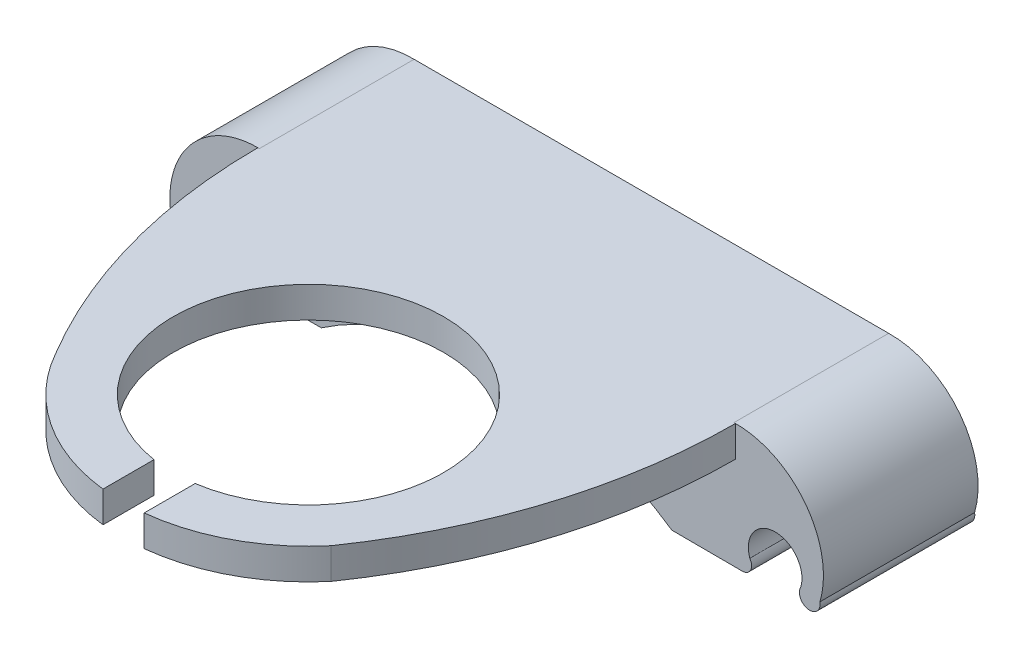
ISO-10303-21;
HEADER;
FILE_DESCRIPTION(('STEP AP214'),'2;1');
FILE_NAME('part.step','',(''),(''),'','','');
FILE_SCHEMA(('AUTOMOTIVE_DESIGN { 1 0 10303 214 1 1 1 1 }'));
ENDSEC;
DATA;
#1=APPLICATION_CONTEXT('core data for automotive mechanical design processes');
#2=APPLICATION_PROTOCOL_DEFINITION('international standard','automotive_design',2000,#1);
#3=PRODUCT_CONTEXT('',#1,'mechanical');
#4=PRODUCT('Part','Part','',(#3));
#5=PRODUCT_RELATED_PRODUCT_CATEGORY('part','',(#4));
#6=PRODUCT_DEFINITION_FORMATION('','',#4);
#7=PRODUCT_DEFINITION_CONTEXT('part definition',#1,'design');
#8=PRODUCT_DEFINITION('design','',#6,#7);
#9=PRODUCT_DEFINITION_SHAPE('','',#8);
#10=(LENGTH_UNIT() NAMED_UNIT(*) SI_UNIT(.MILLI.,.METRE.));
#11=(NAMED_UNIT(*) PLANE_ANGLE_UNIT() SI_UNIT($,.RADIAN.));
#12=(NAMED_UNIT(*) SI_UNIT($,.STERADIAN.) SOLID_ANGLE_UNIT());
#13=UNCERTAINTY_MEASURE_WITH_UNIT(LENGTH_MEASURE(1.E-05),#10,'distance_accuracy_value','');
#14=(GEOMETRIC_REPRESENTATION_CONTEXT(3) GLOBAL_UNCERTAINTY_ASSIGNED_CONTEXT((#13)) GLOBAL_UNIT_ASSIGNED_CONTEXT((#10,
#11,#12)) REPRESENTATION_CONTEXT('',''));
#15=CARTESIAN_POINT('',(0.,0.,0.));
#16=DIRECTION('',(0.,0.,1.));
#17=DIRECTION('',(1.,0.,0.));
#18=AXIS2_PLACEMENT_3D('',#15,#16,#17);
#19=CARTESIAN_POINT('',(-54.7671071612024,12.0368571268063,15.));
#20=DIRECTION('',(0.,-1.,0.));
#21=DIRECTION('',(1.,0.,0.));
#22=AXIS2_PLACEMENT_3D('',#19,#20,#21);
#23=PLANE('',#22);
#24=DIRECTION('',(0.,0.,1.));
#25=VECTOR('',#24,1.);
#26=CARTESIAN_POINT('',(-33.7671071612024,12.0368571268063,15.));
#27=LINE('',#26,#25);
#28=CARTESIAN_POINT('',(-33.7671071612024,12.0368571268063,46.2129085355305));
#29=VERTEX_POINT('',#28);
#30=CARTESIAN_POINT('',(-33.7671071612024,12.0368571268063,51.1567570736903));
#31=VERTEX_POINT('',#30);
#32=EDGE_CURVE('E332',#29,#31,#27,.T.);
#33=ORIENTED_EDGE('',*,*,#32,.F.);
#34=CARTESIAN_POINT('',(-31.7381994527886,12.0368571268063,33.2709792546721));
#35=DIRECTION('',(0.,-1.,0.));
#36=DIRECTION('',(1.,0.,0.));
#37=AXIS2_PLACEMENT_3D('',#34,#35,#36);
#38=CIRCLE('',#37,13.1);
#39=CARTESIAN_POINT('',(-29.7671071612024,12.0368571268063,46.221840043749));
#40=VERTEX_POINT('',#39);
#41=EDGE_CURVE('E191',#29,#40,#38,.T.);
#42=ORIENTED_EDGE('',*,*,#41,.T.);
#43=DIRECTION('',(0.,0.,-1.));
#44=VECTOR('',#43,1.);
#45=CARTESIAN_POINT('',(-29.7671071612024,12.0368571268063,15.));
#46=LINE('',#45,#44);
#47=CARTESIAN_POINT('',(-29.7671071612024,12.0368571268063,51.1632208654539));
#48=VERTEX_POINT('',#47);
#49=EDGE_CURVE('E54',#48,#40,#46,.T.);
#50=ORIENTED_EDGE('',*,*,#49,.F.);
#51=CARTESIAN_POINT('',(-31.7381994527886,12.0368571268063,33.2709792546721));
#52=DIRECTION('',(0.,-1.,0.));
#53=DIRECTION('',(1.,0.,0.));
#54=AXIS2_PLACEMENT_3D('',#51,#52,#53);
#55=CIRCLE('',#54,18.0004865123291);
#56=CARTESIAN_POINT('',(-17.9569114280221,12.0368571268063,44.8508590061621));
#57=VERTEX_POINT('',#56);
#58=EDGE_CURVE('E203',#57,#48,#55,.T.);
#59=ORIENTED_EDGE('',*,*,#58,.F.);
#60=CARTESIAN_POINT('',(-61.0050093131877,12.0368571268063,15.));
#61=DIRECTION('',(0.,-1.,0.));
#62=DIRECTION('',(1.,0.,0.));
#63=AXIS2_PLACEMENT_3D('',#60,#61,#62);
#64=CIRCLE('',#63,52.3852318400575);
#65=CARTESIAN_POINT('',(-8.61977747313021,12.0368571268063,15.));
#66=VERTEX_POINT('',#65);
#67=EDGE_CURVE('E211',#66,#57,#64,.T.);
#68=ORIENTED_EDGE('',*,*,#67,.F.);
#69=DIRECTION('',(1.,0.,0.));
#70=VECTOR('',#69,1.);
#71=CARTESIAN_POINT('',(-54.9144368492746,12.0368571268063,15.));
#72=LINE('',#71,#70);
#73=CARTESIAN_POINT('',(-8.76710716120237,12.0368571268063,15.));
#74=VERTEX_POINT('',#73);
#75=EDGE_CURVE('E180',#74,#66,#72,.T.);
#76=ORIENTED_EDGE('',*,*,#75,.F.);
#77=DIRECTION('',(0.,0.,-1.));
#78=VECTOR('',#77,1.);
#79=CARTESIAN_POINT('',(-8.76710716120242,12.0368571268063,15.));
#80=LINE('',#79,#78);
#81=CARTESIAN_POINT('',(-8.76710716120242,12.0368571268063,0.));
#82=VERTEX_POINT('',#81);
#83=EDGE_CURVE('E293',#74,#82,#80,.T.);
#84=ORIENTED_EDGE('',*,*,#83,.T.);
#85=DIRECTION('',(-1.,0.,0.));
#86=VECTOR('',#85,1.);
#87=CARTESIAN_POINT('',(-54.7671071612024,12.0368571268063,0.));
#88=LINE('',#87,#86);
#89=CARTESIAN_POINT('',(-54.7671071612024,12.0368571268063,0.));
#90=VERTEX_POINT('',#89);
#91=EDGE_CURVE('E265',#82,#90,#88,.T.);
#92=ORIENTED_EDGE('',*,*,#91,.T.);
#93=DIRECTION('',(0.,0.,-1.));
#94=VECTOR('',#93,1.);
#95=CARTESIAN_POINT('',(-54.7671071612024,12.0368571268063,15.));
#96=LINE('',#95,#94);
#97=CARTESIAN_POINT('',(-54.7671071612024,12.0368571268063,15.));
#98=VERTEX_POINT('',#97);
#99=EDGE_CURVE('E290',#98,#90,#96,.T.);
#100=ORIENTED_EDGE('',*,*,#99,.F.);
#101=CARTESIAN_POINT('',(-54.9144368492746,12.0368571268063,15.));
#102=VERTEX_POINT('',#101);
#103=EDGE_CURVE('E193',#102,#98,#72,.T.);
#104=ORIENTED_EDGE('',*,*,#103,.F.);
#105=CARTESIAN_POINT('',(-2.1533602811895,12.0368571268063,15.));
#106=DIRECTION('',(0.,-1.,0.));
#107=DIRECTION('',(-1.,0.,0.));
#108=AXIS2_PLACEMENT_3D('',#105,#106,#107);
#109=CIRCLE('',#108,52.7610765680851);
#110=CARTESIAN_POINT('',(-47.4533224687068,12.0368571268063,42.0489302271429));
#111=VERTEX_POINT('',#110);
#112=EDGE_CURVE('E190',#111,#102,#109,.T.);
#113=ORIENTED_EDGE('',*,*,#112,.F.);
#114=EDGE_CURVE('E213',#31,#111,#55,.T.);
#115=ORIENTED_EDGE('',*,*,#114,.F.);
#116=EDGE_LOOP('',(#33,#42,#50,#59,#68,#76,#84,#92,#100,#104,#113,#115));
#117=FACE_BOUND('',#116,.T.);
#118=ADVANCED_FACE('F39',(#117),#23,.F.);
#119=CARTESIAN_POINT('',(-2.1533602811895,9.03685712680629,15.));
#120=DIRECTION('',(0.,1.,0.));
#121=DIRECTION('',(-1.,0.,0.));
#122=AXIS2_PLACEMENT_3D('',#119,#120,#121);
#123=PLANE('',#122);
#124=DIRECTION('',(0.,0.,-1.));
#125=VECTOR('',#124,1.);
#126=CARTESIAN_POINT('',(-33.7671071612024,9.03685712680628,15.));
#127=LINE('',#126,#125);
#128=CARTESIAN_POINT('',(-33.7671071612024,9.03685712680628,51.1567570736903));
#129=VERTEX_POINT('',#128);
#130=CARTESIAN_POINT('',(-33.7671071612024,9.03685712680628,46.2129085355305));
#131=VERTEX_POINT('',#130);
#132=EDGE_CURVE('E62',#129,#131,#127,.T.);
#133=ORIENTED_EDGE('',*,*,#132,.F.);
#134=CARTESIAN_POINT('',(-31.7381994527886,9.03685712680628,33.2709792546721));
#135=DIRECTION('',(0.,-1.,0.));
#136=DIRECTION('',(1.,0.,0.));
#137=AXIS2_PLACEMENT_3D('',#134,#135,#136);
#138=CIRCLE('',#137,18.0004865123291);
#139=CARTESIAN_POINT('',(-47.4533224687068,9.03685712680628,42.0489302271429));
#140=VERTEX_POINT('',#139);
#141=EDGE_CURVE('E207',#129,#140,#138,.T.);
#142=ORIENTED_EDGE('',*,*,#141,.T.);
#143=CARTESIAN_POINT('',(-2.1533602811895,9.03685712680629,15.));
#144=DIRECTION('',(0.,-1.,0.));
#145=DIRECTION('',(-1.,0.,0.));
#146=AXIS2_PLACEMENT_3D('',#143,#144,#145);
#147=CIRCLE('',#146,52.7610765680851);
#148=CARTESIAN_POINT('',(-54.9144368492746,9.03685712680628,15.));
#149=VERTEX_POINT('',#148);
#150=EDGE_CURVE('E200',#140,#149,#147,.T.);
#151=ORIENTED_EDGE('',*,*,#150,.T.);
#152=DIRECTION('',(1.,0.,0.));
#153=VECTOR('',#152,1.);
#154=CARTESIAN_POINT('',(-54.9144368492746,9.03685712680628,15.));
#155=LINE('',#154,#153);
#156=CARTESIAN_POINT('',(-8.61977747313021,9.03685712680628,15.));
#157=VERTEX_POINT('',#156);
#158=EDGE_CURVE('E202',#149,#157,#155,.T.);
#159=ORIENTED_EDGE('',*,*,#158,.T.);
#160=CARTESIAN_POINT('',(-61.0050093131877,9.03685712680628,15.));
#161=DIRECTION('',(0.,-1.,0.));
#162=DIRECTION('',(1.,0.,0.));
#163=AXIS2_PLACEMENT_3D('',#160,#161,#162);
#164=CIRCLE('',#163,52.3852318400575);
#165=CARTESIAN_POINT('',(-17.9569114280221,9.03685712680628,44.8508590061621));
#166=VERTEX_POINT('',#165);
#167=EDGE_CURVE('E205',#157,#166,#164,.T.);
#168=ORIENTED_EDGE('',*,*,#167,.T.);
#169=CARTESIAN_POINT('',(-29.7671071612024,9.03685712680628,51.1632208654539));
#170=VERTEX_POINT('',#169);
#171=EDGE_CURVE('E187',#166,#170,#138,.T.);
#172=ORIENTED_EDGE('',*,*,#171,.T.);
#173=DIRECTION('',(0.,0.,1.));
#174=VECTOR('',#173,1.);
#175=CARTESIAN_POINT('',(-29.7671071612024,9.03685712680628,15.));
#176=LINE('',#175,#174);
#177=CARTESIAN_POINT('',(-29.7671071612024,9.03685712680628,46.221840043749));
#178=VERTEX_POINT('',#177);
#179=EDGE_CURVE('E174',#178,#170,#176,.T.);
#180=ORIENTED_EDGE('',*,*,#179,.F.);
#181=CARTESIAN_POINT('',(-31.7381994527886,9.03685712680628,33.2709792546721));
#182=DIRECTION('',(0.,-1.,0.));
#183=DIRECTION('',(1.,0.,0.));
#184=AXIS2_PLACEMENT_3D('',#181,#182,#183);
#185=CIRCLE('',#184,13.1);
#186=EDGE_CURVE('E185',#131,#178,#185,.T.);
#187=ORIENTED_EDGE('',*,*,#186,.F.);
#188=EDGE_LOOP('',(#133,#142,#151,#159,#168,#172,#180,#187));
#189=FACE_BOUND('',#188,.T.);
#190=ADVANCED_FACE('F184',(#189),#123,.F.);
#191=CARTESIAN_POINT('',(-31.7381994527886,9.03685712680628,33.2709792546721));
#192=DIRECTION('',(0.,1.,0.));
#193=DIRECTION('',(-1.,0.,0.));
#194=AXIS2_PLACEMENT_3D('',#191,#192,#193);
#195=CYLINDRICAL_SURFACE('',#194,18.0004865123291);
#196=DIRECTION('',(0.,1.,0.));
#197=VECTOR('',#196,1.);
#198=CARTESIAN_POINT('',(-33.7671071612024,9.03685712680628,51.1567570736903));
#199=LINE('',#198,#197);
#200=EDGE_CURVE('E195',#31,#129,#199,.F.);
#201=ORIENTED_EDGE('',*,*,#200,.F.);
#202=ORIENTED_EDGE('',*,*,#114,.T.);
#203=DIRECTION('',(0.,1.,0.));
#204=VECTOR('',#203,1.);
#205=CARTESIAN_POINT('',(-47.4533224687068,9.03685712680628,42.0489302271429));
#206=LINE('',#205,#204);
#207=EDGE_CURVE('E208',#140,#111,#206,.T.);
#208=ORIENTED_EDGE('',*,*,#207,.F.);
#209=ORIENTED_EDGE('',*,*,#141,.F.);
#210=EDGE_LOOP('',(#201,#202,#208,#209));
#211=FACE_BOUND('',#210,.T.);
#212=ADVANCED_FACE('F341',(#211),#195,.T.);
#213=DIRECTION('',(0.,1.,0.));
#214=VECTOR('',#213,1.);
#215=CARTESIAN_POINT('',(-29.7671071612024,9.03685712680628,51.1632208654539));
#216=LINE('',#215,#214);
#217=EDGE_CURVE('E330',#170,#48,#216,.T.);
#218=ORIENTED_EDGE('',*,*,#217,.F.);
#219=ORIENTED_EDGE('',*,*,#171,.F.);
#220=DIRECTION('',(0.,1.,0.));
#221=VECTOR('',#220,1.);
#222=CARTESIAN_POINT('',(-17.9569114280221,9.03685712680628,44.8508590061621));
#223=LINE('',#222,#221);
#224=EDGE_CURVE('E218',#166,#57,#223,.T.);
#225=ORIENTED_EDGE('',*,*,#224,.T.);
#226=ORIENTED_EDGE('',*,*,#58,.T.);
#227=EDGE_LOOP('',(#218,#219,#225,#226));
#228=FACE_BOUND('',#227,.T.);
#229=ADVANCED_FACE('F329',(#228),#195,.T.);
#230=CARTESIAN_POINT('',(-31.7381994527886,9.03685712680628,33.2709792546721));
#231=DIRECTION('',(0.,1.,0.));
#232=DIRECTION('',(-1.,0.,0.));
#233=AXIS2_PLACEMENT_3D('',#230,#231,#232);
#234=CYLINDRICAL_SURFACE('',#233,13.1);
#235=ORIENTED_EDGE('',*,*,#41,.F.);
#236=DIRECTION('',(0.,1.,0.));
#237=VECTOR('',#236,1.);
#238=CARTESIAN_POINT('',(-33.7671071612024,9.03685712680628,46.2129085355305));
#239=LINE('',#238,#237);
#240=EDGE_CURVE('E11',#29,#131,#239,.F.);
#241=ORIENTED_EDGE('',*,*,#240,.T.);
#242=ORIENTED_EDGE('',*,*,#186,.T.);
#243=DIRECTION('',(0.,1.,0.));
#244=VECTOR('',#243,1.);
#245=CARTESIAN_POINT('',(-29.7671071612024,9.03685712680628,46.221840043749));
#246=LINE('',#245,#244);
#247=EDGE_CURVE('E47',#178,#40,#246,.T.);
#248=ORIENTED_EDGE('',*,*,#247,.T.);
#249=EDGE_LOOP('',(#235,#241,#242,#248));
#250=FACE_BOUND('',#249,.T.);
#251=ADVANCED_FACE('F189',(#250),#234,.F.);
#252=CARTESIAN_POINT('',(-31.7671071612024,-24.9702545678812,15.));
#253=DIRECTION('',(0.,0.,-1.));
#254=DIRECTION('',(-1.,0.,0.));
#255=AXIS2_PLACEMENT_3D('',#252,#253,#254);
#256=CYLINDRICAL_SURFACE('',#255,30.2);
#257=CARTESIAN_POINT('',(-31.7671071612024,-24.9702545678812,0.));
#258=DIRECTION('',(0.,0.,-1.));
#259=DIRECTION('',(-1.,0.,0.));
#260=AXIS2_PLACEMENT_3D('',#257,#258,#259);
#261=CIRCLE('',#260,30.2);
#262=CARTESIAN_POINT('',(-48.7531716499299,0.,0.));
#263=VERTEX_POINT('',#262);
#264=CARTESIAN_POINT('',(-14.7810426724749,0.,0.));
#265=VERTEX_POINT('',#264);
#266=EDGE_CURVE('E226',#263,#265,#261,.T.);
#267=ORIENTED_EDGE('',*,*,#266,.T.);
#268=DIRECTION('',(0.,0.,-1.));
#269=VECTOR('',#268,1.);
#270=CARTESIAN_POINT('',(-14.7810426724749,0.,15.));
#271=LINE('',#270,#269);
#272=CARTESIAN_POINT('',(-14.7810426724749,0.,15.));
#273=VERTEX_POINT('',#272);
#274=EDGE_CURVE('E308',#273,#265,#271,.T.);
#275=ORIENTED_EDGE('',*,*,#274,.F.);
#276=CARTESIAN_POINT('',(-31.7671071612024,-24.9702545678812,15.));
#277=DIRECTION('',(0.,0.,-1.));
#278=DIRECTION('',(-1.,0.,0.));
#279=AXIS2_PLACEMENT_3D('',#276,#277,#278);
#280=CIRCLE('',#279,30.2);
#281=CARTESIAN_POINT('',(-48.7531716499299,0.,15.));
#282=VERTEX_POINT('',#281);
#283=EDGE_CURVE('E227',#282,#273,#280,.T.);
#284=ORIENTED_EDGE('',*,*,#283,.F.);
#285=DIRECTION('',(0.,0.,-1.));
#286=VECTOR('',#285,1.);
#287=CARTESIAN_POINT('',(-48.7531716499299,0.,15.));
#288=LINE('',#287,#286);
#289=EDGE_CURVE('E252',#282,#263,#288,.T.);
#290=ORIENTED_EDGE('',*,*,#289,.T.);
#291=EDGE_LOOP('',(#267,#275,#284,#290));
#292=FACE_BOUND('',#291,.T.);
#293=ADVANCED_FACE('F41',(#292),#256,.F.);
#294=CARTESIAN_POINT('',(-14.7810426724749,0.,15.));
#295=DIRECTION('',(0.00375470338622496,0.999992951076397,0.));
#296=DIRECTION('',(-0.999992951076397,0.00375470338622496,0.));
#297=AXIS2_PLACEMENT_3D('',#294,#295,#296);
#298=PLANE('',#297);
#299=DIRECTION('',(0.999992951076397,-0.00375470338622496,0.));
#300=VECTOR('',#299,1.);
#301=CARTESIAN_POINT('',(-14.7810426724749,0.,0.));
#302=LINE('',#301,#300);
#303=CARTESIAN_POINT('',(-7.95931495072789,-0.0256137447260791,0.));
#304=VERTEX_POINT('',#303);
#305=EDGE_CURVE('E255',#265,#304,#302,.T.);
#306=ORIENTED_EDGE('',*,*,#305,.T.);
#307=DIRECTION('',(0.,0.,-1.));
#308=VECTOR('',#307,1.);
#309=CARTESIAN_POINT('',(-7.95931495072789,-0.0256137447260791,15.));
#310=LINE('',#309,#308);
#311=CARTESIAN_POINT('',(-7.95931495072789,-0.0256137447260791,15.));
#312=VERTEX_POINT('',#311);
#313=EDGE_CURVE('E305',#312,#304,#310,.T.);
#314=ORIENTED_EDGE('',*,*,#313,.F.);
#315=DIRECTION('',(0.999992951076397,-0.00375470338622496,0.));
#316=VECTOR('',#315,1.);
#317=CARTESIAN_POINT('',(-14.7810426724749,0.,15.));
#318=LINE('',#317,#316);
#319=EDGE_CURVE('E230',#273,#312,#318,.T.);
#320=ORIENTED_EDGE('',*,*,#319,.F.);
#321=ORIENTED_EDGE('',*,*,#274,.T.);
#322=EDGE_LOOP('',(#306,#314,#320,#321));
#323=FACE_BOUND('',#322,.T.);
#324=ADVANCED_FACE('F382',(#323),#298,.F.);
#325=CARTESIAN_POINT('',(-7.95591623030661,0.87956999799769,15.));
#326=DIRECTION('',(0.,0.,-1.));
#327=DIRECTION('',(-1.,0.,0.));
#328=AXIS2_PLACEMENT_3D('',#325,#326,#327);
#329=CYLINDRICAL_SURFACE('',#328,0.905190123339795);
#330=CARTESIAN_POINT('',(-7.95591623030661,0.87956999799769,0.));
#331=DIRECTION('',(0.,0.,1.));
#332=DIRECTION('',(1.,0.,0.));
#333=AXIS2_PLACEMENT_3D('',#330,#331,#332);
#334=CIRCLE('',#333,0.905190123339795);
#335=CARTESIAN_POINT('',(-7.22438969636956,1.41270983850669,0.));
#336=VERTEX_POINT('',#335);
#337=EDGE_CURVE('E257',#304,#336,#334,.T.);
#338=ORIENTED_EDGE('',*,*,#337,.T.);
#339=DIRECTION('',(0.,0.,-1.));
#340=VECTOR('',#339,1.);
#341=CARTESIAN_POINT('',(-7.22438969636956,1.41270983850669,15.));
#342=LINE('',#341,#340);
#343=CARTESIAN_POINT('',(-7.22438969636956,1.41270983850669,15.));
#344=VERTEX_POINT('',#343);
#345=EDGE_CURVE('E302',#344,#336,#342,.T.);
#346=ORIENTED_EDGE('',*,*,#345,.F.);
#347=CARTESIAN_POINT('',(-7.95591623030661,0.87956999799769,15.));
#348=DIRECTION('',(0.,0.,1.));
#349=DIRECTION('',(1.,0.,0.));
#350=AXIS2_PLACEMENT_3D('',#347,#348,#349);
#351=CIRCLE('',#350,0.905190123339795);
#352=EDGE_CURVE('E233',#312,#344,#351,.T.);
#353=ORIENTED_EDGE('',*,*,#352,.F.);
#354=ORIENTED_EDGE('',*,*,#313,.T.);
#355=EDGE_LOOP('',(#338,#346,#353,#354));
#356=FACE_BOUND('',#355,.T.);
#357=ADVANCED_FACE('F385',(#356),#329,.T.);
#358=CARTESIAN_POINT('',(-4.76710716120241,2.26227592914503,15.));
#359=DIRECTION('',(0.,0.,-1.));
#360=DIRECTION('',(-1.,0.,0.));
#361=AXIS2_PLACEMENT_3D('',#358,#359,#360);
#362=CYLINDRICAL_SURFACE('',#361,2.6);
#363=CARTESIAN_POINT('',(-4.76710716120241,2.26227592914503,0.));
#364=DIRECTION('',(0.,0.,-1.));
#365=DIRECTION('',(-1.,0.,0.));
#366=AXIS2_PLACEMENT_3D('',#363,#364,#365);
#367=CIRCLE('',#366,2.6);
#368=CARTESIAN_POINT('',(-2.31050998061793,1.4107301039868,0.));
#369=VERTEX_POINT('',#368);
#370=EDGE_CURVE('E259',#336,#369,#367,.T.);
#371=ORIENTED_EDGE('',*,*,#370,.T.);
#372=DIRECTION('',(0.,0.,-1.));
#373=VECTOR('',#372,1.);
#374=CARTESIAN_POINT('',(-2.31050998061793,1.4107301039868,15.));
#375=LINE('',#374,#373);
#376=CARTESIAN_POINT('',(-2.31050998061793,1.4107301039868,15.));
#377=VERTEX_POINT('',#376);
#378=EDGE_CURVE('E299',#377,#369,#375,.T.);
#379=ORIENTED_EDGE('',*,*,#378,.F.);
#380=CARTESIAN_POINT('',(-4.76710716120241,2.26227592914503,15.));
#381=DIRECTION('',(0.,0.,-1.));
#382=DIRECTION('',(-1.,0.,0.));
#383=AXIS2_PLACEMENT_3D('',#380,#381,#382);
#384=CIRCLE('',#383,2.6);
#385=EDGE_CURVE('E235',#344,#377,#384,.T.);
#386=ORIENTED_EDGE('',*,*,#385,.F.);
#387=ORIENTED_EDGE('',*,*,#345,.T.);
#388=EDGE_LOOP('',(#371,#379,#386,#387));
#389=FACE_BOUND('',#388,.T.);
#390=ADVANCED_FACE('F392',(#389),#362,.F.);
#391=CARTESIAN_POINT('',(-1.419234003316,0.957268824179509,15.));
#392=DIRECTION('',(0.,0.,-1.));
#393=DIRECTION('',(-1.,0.,0.));
#394=AXIS2_PLACEMENT_3D('',#391,#392,#393);
#395=CYLINDRICAL_SURFACE('',#394,0.999999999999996);
#396=CARTESIAN_POINT('',(-1.419234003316,0.957268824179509,0.));
#397=DIRECTION('',(0.,0.,1.));
#398=DIRECTION('',(1.,0.,0.));
#399=AXIS2_PLACEMENT_3D('',#396,#397,#398);
#400=CIRCLE('',#399,0.999999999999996);
#401=CARTESIAN_POINT('',(-0.438470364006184,1.15246791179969,0.));
#402=VERTEX_POINT('',#401);
#403=EDGE_CURVE('E261',#369,#402,#400,.T.);
#404=ORIENTED_EDGE('',*,*,#403,.T.);
#405=DIRECTION('',(0.,0.,-1.));
#406=VECTOR('',#405,1.);
#407=CARTESIAN_POINT('',(-0.438470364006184,1.15246791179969,15.));
#408=LINE('',#407,#406);
#409=CARTESIAN_POINT('',(-0.438470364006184,1.15246791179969,15.));
#410=VERTEX_POINT('',#409);
#411=EDGE_CURVE('E296',#410,#402,#408,.T.);
#412=ORIENTED_EDGE('',*,*,#411,.F.);
#413=CARTESIAN_POINT('',(-1.419234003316,0.957268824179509,15.));
#414=DIRECTION('',(0.,0.,1.));
#415=DIRECTION('',(1.,0.,0.));
#416=AXIS2_PLACEMENT_3D('',#413,#414,#415);
#417=CIRCLE('',#416,0.999999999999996);
#418=EDGE_CURVE('E237',#377,#410,#417,.T.);
#419=ORIENTED_EDGE('',*,*,#418,.F.);
#420=ORIENTED_EDGE('',*,*,#378,.T.);
#421=EDGE_LOOP('',(#404,#412,#419,#420));
#422=FACE_BOUND('',#421,.T.);
#423=ADVANCED_FACE('F395',(#422),#395,.T.);
#424=CARTESIAN_POINT('',(-8.59668938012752,3.53856566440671,15.));
#425=DIRECTION('',(0.,0.,-1.));
#426=DIRECTION('',(-1.,0.,0.));
#427=AXIS2_PLACEMENT_3D('',#424,#425,#426);
#428=CYLINDRICAL_SURFACE('',#427,8.5);
#429=CARTESIAN_POINT('',(-8.59668938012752,3.53856566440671,0.));
#430=DIRECTION('',(0.,0.,1.));
#431=DIRECTION('',(1.,0.,0.));
#432=AXIS2_PLACEMENT_3D('',#429,#430,#431);
#433=CIRCLE('',#432,8.5);
#434=EDGE_CURVE('E263',#402,#82,#433,.T.);
#435=ORIENTED_EDGE('',*,*,#434,.T.);
#436=ORIENTED_EDGE('',*,*,#83,.F.);
#437=CARTESIAN_POINT('',(-8.59668938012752,3.53856566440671,15.));
#438=DIRECTION('',(0.,0.,1.));
#439=DIRECTION('',(1.,0.,0.));
#440=AXIS2_PLACEMENT_3D('',#437,#438,#439);
#441=CIRCLE('',#440,8.5);
#442=EDGE_CURVE('E239',#410,#74,#441,.T.);
#443=ORIENTED_EDGE('',*,*,#442,.F.);
#444=ORIENTED_EDGE('',*,*,#411,.T.);
#445=EDGE_LOOP('',(#435,#436,#443,#444));
#446=FACE_BOUND('',#445,.T.);
#447=ADVANCED_FACE('F398',(#446),#428,.T.);
#448=CARTESIAN_POINT('',(-54.9375249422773,3.5385656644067,15.));
#449=DIRECTION('',(0.,0.,-1.));
#450=DIRECTION('',(-1.,0.,0.));
#451=AXIS2_PLACEMENT_3D('',#448,#449,#450);
#452=CYLINDRICAL_SURFACE('',#451,8.5);
#453=CARTESIAN_POINT('',(-54.9375249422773,3.5385656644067,0.));
#454=DIRECTION('',(0.,0.,1.));
#455=DIRECTION('',(-1.,0.,0.));
#456=AXIS2_PLACEMENT_3D('',#453,#454,#455);
#457=CIRCLE('',#456,8.5);
#458=CARTESIAN_POINT('',(-63.0957439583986,1.15246791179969,0.));
#459=VERTEX_POINT('',#458);
#460=EDGE_CURVE('E267',#90,#459,#457,.T.);
#461=ORIENTED_EDGE('',*,*,#460,.T.);
#462=DIRECTION('',(0.,0.,-1.));
#463=VECTOR('',#462,1.);
#464=CARTESIAN_POINT('',(-63.0957439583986,1.15246791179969,15.));
#465=LINE('',#464,#463);
#466=CARTESIAN_POINT('',(-63.0957439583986,1.15246791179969,15.));
#467=VERTEX_POINT('',#466);
#468=EDGE_CURVE('E287',#467,#459,#465,.T.);
#469=ORIENTED_EDGE('',*,*,#468,.F.);
#470=CARTESIAN_POINT('',(-54.9375249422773,3.5385656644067,15.));
#471=DIRECTION('',(0.,0.,1.));
#472=DIRECTION('',(-1.,0.,0.));
#473=AXIS2_PLACEMENT_3D('',#470,#471,#472);
#474=CIRCLE('',#473,8.5);
#475=EDGE_CURVE('E242',#98,#467,#474,.T.);
#476=ORIENTED_EDGE('',*,*,#475,.F.);
#477=ORIENTED_EDGE('',*,*,#99,.T.);
#478=EDGE_LOOP('',(#461,#469,#476,#477));
#479=FACE_BOUND('',#478,.T.);
#480=ADVANCED_FACE('F353',(#479),#452,.T.);
#481=CARTESIAN_POINT('',(-62.1149803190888,0.957268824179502,15.));
#482=DIRECTION('',(0.,0.,-1.));
#483=DIRECTION('',(-1.,0.,0.));
#484=AXIS2_PLACEMENT_3D('',#481,#482,#483);
#485=CYLINDRICAL_SURFACE('',#484,0.999999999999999);
#486=CARTESIAN_POINT('',(-62.1149803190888,0.957268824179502,0.));
#487=DIRECTION('',(0.,0.,1.));
#488=DIRECTION('',(-1.,0.,0.));
#489=AXIS2_PLACEMENT_3D('',#486,#487,#488);
#490=CIRCLE('',#489,0.999999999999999);
#491=CARTESIAN_POINT('',(-61.2237043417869,1.4107301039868,0.));
#492=VERTEX_POINT('',#491);
#493=EDGE_CURVE('E269',#459,#492,#490,.T.);
#494=ORIENTED_EDGE('',*,*,#493,.T.);
#495=DIRECTION('',(0.,0.,-1.));
#496=VECTOR('',#495,1.);
#497=CARTESIAN_POINT('',(-61.2237043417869,1.4107301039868,15.));
#498=LINE('',#497,#496);
#499=CARTESIAN_POINT('',(-61.2237043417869,1.4107301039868,15.));
#500=VERTEX_POINT('',#499);
#501=EDGE_CURVE('E284',#500,#492,#498,.T.);
#502=ORIENTED_EDGE('',*,*,#501,.F.);
#503=CARTESIAN_POINT('',(-62.1149803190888,0.957268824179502,15.));
#504=DIRECTION('',(0.,0.,1.));
#505=DIRECTION('',(-1.,0.,0.));
#506=AXIS2_PLACEMENT_3D('',#503,#504,#505);
#507=CIRCLE('',#506,0.999999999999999);
#508=EDGE_CURVE('E244',#467,#500,#507,.T.);
#509=ORIENTED_EDGE('',*,*,#508,.F.);
#510=ORIENTED_EDGE('',*,*,#468,.T.);
#511=EDGE_LOOP('',(#494,#502,#509,#510));
#512=FACE_BOUND('',#511,.T.);
#513=ADVANCED_FACE('F358',(#512),#485,.T.);
#514=CARTESIAN_POINT('',(-58.7671071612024,2.26227592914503,15.));
#515=DIRECTION('',(0.,0.,-1.));
#516=DIRECTION('',(-1.,0.,0.));
#517=AXIS2_PLACEMENT_3D('',#514,#515,#516);
#518=CYLINDRICAL_SURFACE('',#517,2.6);
#519=CARTESIAN_POINT('',(-58.7671071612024,2.26227592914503,0.));
#520=DIRECTION('',(0.,0.,-1.));
#521=DIRECTION('',(1.,0.,0.));
#522=AXIS2_PLACEMENT_3D('',#519,#520,#521);
#523=CIRCLE('',#522,2.6);
#524=CARTESIAN_POINT('',(-56.3098246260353,1.41270983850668,0.));
#525=VERTEX_POINT('',#524);
#526=EDGE_CURVE('E271',#492,#525,#523,.T.);
#527=ORIENTED_EDGE('',*,*,#526,.T.);
#528=DIRECTION('',(0.,0.,-1.));
#529=VECTOR('',#528,1.);
#530=CARTESIAN_POINT('',(-56.3098246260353,1.41270983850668,15.));
#531=LINE('',#530,#529);
#532=CARTESIAN_POINT('',(-56.3098246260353,1.41270983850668,15.));
#533=VERTEX_POINT('',#532);
#534=EDGE_CURVE('E281',#533,#525,#531,.T.);
#535=ORIENTED_EDGE('',*,*,#534,.F.);
#536=CARTESIAN_POINT('',(-58.7671071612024,2.26227592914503,15.));
#537=DIRECTION('',(0.,0.,-1.));
#538=DIRECTION('',(1.,0.,0.));
#539=AXIS2_PLACEMENT_3D('',#536,#537,#538);
#540=CIRCLE('',#539,2.6);
#541=EDGE_CURVE('E246',#500,#533,#540,.T.);
#542=ORIENTED_EDGE('',*,*,#541,.F.);
#543=ORIENTED_EDGE('',*,*,#501,.T.);
#544=EDGE_LOOP('',(#527,#535,#542,#543));
#545=FACE_BOUND('',#544,.T.);
#546=ADVANCED_FACE('F364',(#545),#518,.F.);
#547=CARTESIAN_POINT('',(-55.5782980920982,0.879569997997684,15.));
#548=DIRECTION('',(0.,0.,-1.));
#549=DIRECTION('',(-1.,0.,0.));
#550=AXIS2_PLACEMENT_3D('',#547,#548,#549);
#551=CYLINDRICAL_SURFACE('',#550,0.905190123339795);
#552=CARTESIAN_POINT('',(-55.5782980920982,0.879569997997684,0.));
#553=DIRECTION('',(0.,0.,1.));
#554=DIRECTION('',(-1.,0.,0.));
#555=AXIS2_PLACEMENT_3D('',#552,#553,#554);
#556=CIRCLE('',#555,0.905190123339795);
#557=CARTESIAN_POINT('',(-55.5748993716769,-0.0256137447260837,0.));
#558=VERTEX_POINT('',#557);
#559=EDGE_CURVE('E273',#525,#558,#556,.T.);
#560=ORIENTED_EDGE('',*,*,#559,.T.);
#561=DIRECTION('',(0.,0.,-1.));
#562=VECTOR('',#561,1.);
#563=CARTESIAN_POINT('',(-55.5748993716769,-0.0256137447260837,15.));
#564=LINE('',#563,#562);
#565=CARTESIAN_POINT('',(-55.5748993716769,-0.0256137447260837,15.));
#566=VERTEX_POINT('',#565);
#567=EDGE_CURVE('E278',#566,#558,#564,.T.);
#568=ORIENTED_EDGE('',*,*,#567,.F.);
#569=CARTESIAN_POINT('',(-55.5782980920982,0.879569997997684,15.));
#570=DIRECTION('',(0.,0.,1.));
#571=DIRECTION('',(-1.,0.,0.));
#572=AXIS2_PLACEMENT_3D('',#569,#570,#571);
#573=CIRCLE('',#572,0.905190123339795);
#574=EDGE_CURVE('E248',#533,#566,#573,.T.);
#575=ORIENTED_EDGE('',*,*,#574,.F.);
#576=ORIENTED_EDGE('',*,*,#534,.T.);
#577=EDGE_LOOP('',(#560,#568,#575,#576));
#578=FACE_BOUND('',#577,.T.);
#579=ADVANCED_FACE('F368',(#578),#551,.T.);
#580=CARTESIAN_POINT('',(-48.7531716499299,0.,15.));
#581=DIRECTION('',(-0.00375470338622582,0.999992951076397,0.));
#582=DIRECTION('',(-0.999992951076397,-0.00375470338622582,0.));
#583=AXIS2_PLACEMENT_3D('',#580,#581,#582);
#584=PLANE('',#583);
#585=DIRECTION('',(0.999992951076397,0.00375470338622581,0.));
#586=VECTOR('',#585,1.);
#587=CARTESIAN_POINT('',(-48.7531716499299,0.,0.));
#588=LINE('',#587,#586);
#589=EDGE_CURVE('E231',#558,#263,#588,.T.);
#590=ORIENTED_EDGE('',*,*,#589,.T.);
#591=ORIENTED_EDGE('',*,*,#289,.F.);
#592=DIRECTION('',(0.999992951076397,0.00375470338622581,0.));
#593=VECTOR('',#592,1.);
#594=CARTESIAN_POINT('',(-48.7531716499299,0.,15.));
#595=LINE('',#594,#593);
#596=EDGE_CURVE('E250',#566,#282,#595,.T.);
#597=ORIENTED_EDGE('',*,*,#596,.F.);
#598=ORIENTED_EDGE('',*,*,#567,.T.);
#599=EDGE_LOOP('',(#590,#591,#597,#598));
#600=FACE_BOUND('',#599,.T.);
#601=ADVANCED_FACE('F373',(#600),#584,.F.);
#602=CARTESIAN_POINT('',(-31.7671071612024,-24.9702545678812,15.));
#603=DIRECTION('',(0.,0.,-1.));
#604=DIRECTION('',(-1.,0.,0.));
#605=AXIS2_PLACEMENT_3D('',#602,#603,#604);
#606=PLANE('',#605);
#607=DIRECTION('',(0.,1.,0.));
#608=VECTOR('',#607,1.);
#609=CARTESIAN_POINT('',(-54.9144368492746,9.03685712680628,15.));
#610=LINE('',#609,#608);
#611=EDGE_CURVE('E223',#149,#102,#610,.T.);
#612=ORIENTED_EDGE('',*,*,#611,.T.);
#613=ORIENTED_EDGE('',*,*,#103,.T.);
#614=ORIENTED_EDGE('',*,*,#475,.T.);
#615=ORIENTED_EDGE('',*,*,#508,.T.);
#616=ORIENTED_EDGE('',*,*,#541,.T.);
#617=ORIENTED_EDGE('',*,*,#574,.T.);
#618=ORIENTED_EDGE('',*,*,#596,.T.);
#619=ORIENTED_EDGE('',*,*,#283,.T.);
#620=ORIENTED_EDGE('',*,*,#319,.T.);
#621=ORIENTED_EDGE('',*,*,#352,.T.);
#622=ORIENTED_EDGE('',*,*,#385,.T.);
#623=ORIENTED_EDGE('',*,*,#418,.T.);
#624=ORIENTED_EDGE('',*,*,#442,.T.);
#625=ORIENTED_EDGE('',*,*,#75,.T.);
#626=DIRECTION('',(0.,1.,0.));
#627=VECTOR('',#626,1.);
#628=CARTESIAN_POINT('',(-8.61977747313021,9.03685712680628,15.));
#629=LINE('',#628,#627);
#630=EDGE_CURVE('E221',#157,#66,#629,.T.);
#631=ORIENTED_EDGE('',*,*,#630,.F.);
#632=ORIENTED_EDGE('',*,*,#158,.F.);
#633=EDGE_LOOP('',(#612,#613,#614,#615,#616,#617,#618,#619,#620,#621,#622,#623,#624,#625,#631,#632));
#634=FACE_BOUND('',#633,.T.);
#635=ADVANCED_FACE('F315',(#634),#606,.F.);
#636=CARTESIAN_POINT('',(-31.7671071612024,-24.9702545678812,0.));
#637=DIRECTION('',(0.,0.,-1.));
#638=DIRECTION('',(-1.,0.,0.));
#639=AXIS2_PLACEMENT_3D('',#636,#637,#638);
#640=PLANE('',#639);
#641=ORIENTED_EDGE('',*,*,#266,.F.);
#642=ORIENTED_EDGE('',*,*,#589,.F.);
#643=ORIENTED_EDGE('',*,*,#559,.F.);
#644=ORIENTED_EDGE('',*,*,#526,.F.);
#645=ORIENTED_EDGE('',*,*,#493,.F.);
#646=ORIENTED_EDGE('',*,*,#460,.F.);
#647=ORIENTED_EDGE('',*,*,#91,.F.);
#648=ORIENTED_EDGE('',*,*,#434,.F.);
#649=ORIENTED_EDGE('',*,*,#403,.F.);
#650=ORIENTED_EDGE('',*,*,#370,.F.);
#651=ORIENTED_EDGE('',*,*,#337,.F.);
#652=ORIENTED_EDGE('',*,*,#305,.F.);
#653=EDGE_LOOP('',(#641,#642,#643,#644,#645,#646,#647,#648,#649,#650,#651,#652));
#654=FACE_BOUND('',#653,.T.);
#655=ADVANCED_FACE('F379',(#654),#640,.T.);
#656=CARTESIAN_POINT('',(-2.1533602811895,9.03685712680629,15.));
#657=DIRECTION('',(0.,1.,0.));
#658=DIRECTION('',(-1.,0.,0.));
#659=AXIS2_PLACEMENT_3D('',#656,#657,#658);
#660=CYLINDRICAL_SURFACE('',#659,52.7610765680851);
#661=ORIENTED_EDGE('',*,*,#112,.T.);
#662=ORIENTED_EDGE('',*,*,#611,.F.);
#663=ORIENTED_EDGE('',*,*,#150,.F.);
#664=ORIENTED_EDGE('',*,*,#207,.T.);
#665=EDGE_LOOP('',(#661,#662,#663,#664));
#666=FACE_BOUND('',#665,.T.);
#667=ADVANCED_FACE('F346',(#666),#660,.T.);
#668=CARTESIAN_POINT('',(-61.0050093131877,9.03685712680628,15.));
#669=DIRECTION('',(0.,1.,0.));
#670=DIRECTION('',(-1.,0.,0.));
#671=AXIS2_PLACEMENT_3D('',#668,#669,#670);
#672=CYLINDRICAL_SURFACE('',#671,52.3852318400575);
#673=ORIENTED_EDGE('',*,*,#67,.T.);
#674=ORIENTED_EDGE('',*,*,#224,.F.);
#675=ORIENTED_EDGE('',*,*,#167,.F.);
#676=ORIENTED_EDGE('',*,*,#630,.T.);
#677=EDGE_LOOP('',(#673,#674,#675,#676));
#678=FACE_BOUND('',#677,.T.);
#679=ADVANCED_FACE('F326',(#678),#672,.T.);
#680=CARTESIAN_POINT('',(-29.7671071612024,6.96486350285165,51.2714657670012));
#681=DIRECTION('',(-1.,0.,0.));
#682=DIRECTION('',(0.,0.,1.));
#683=AXIS2_PLACEMENT_3D('',#680,#681,#682);
#684=PLANE('',#683);
#685=ORIENTED_EDGE('',*,*,#217,.T.);
#686=ORIENTED_EDGE('',*,*,#49,.T.);
#687=ORIENTED_EDGE('',*,*,#247,.F.);
#688=ORIENTED_EDGE('',*,*,#179,.T.);
#689=EDGE_LOOP('',(#685,#686,#687,#688));
#690=FACE_BOUND('',#689,.T.);
#691=ADVANCED_FACE('F173',(#690),#684,.T.);
#692=CARTESIAN_POINT('',(-33.7671071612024,15.5368571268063,51.2714657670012));
#693=DIRECTION('',(1.,0.,0.));
#694=DIRECTION('',(0.,0.,-1.));
#695=AXIS2_PLACEMENT_3D('',#692,#693,#694);
#696=PLANE('',#695);
#697=ORIENTED_EDGE('',*,*,#200,.T.);
#698=ORIENTED_EDGE('',*,*,#132,.T.);
#699=ORIENTED_EDGE('',*,*,#240,.F.);
#700=ORIENTED_EDGE('',*,*,#32,.T.);
#701=EDGE_LOOP('',(#697,#698,#699,#700));
#702=FACE_BOUND('',#701,.T.);
#703=ADVANCED_FACE('F336',(#702),#696,.T.);
#704=CLOSED_SHELL('',(#118,#190,#212,#229,#251,#293,#324,#357,#390,#423,#447,#480,#513,#546,
#579,#601,#635,#655,#667,#679,#691,#703));
#705=MANIFOLD_SOLID_BREP('B2',#704);
#706=ADVANCED_BREP_SHAPE_REPRESENTATION('',(#18,#705),#14);
#707=SHAPE_DEFINITION_REPRESENTATION(#9,#706);
ENDSEC;
END-ISO-10303-21;
